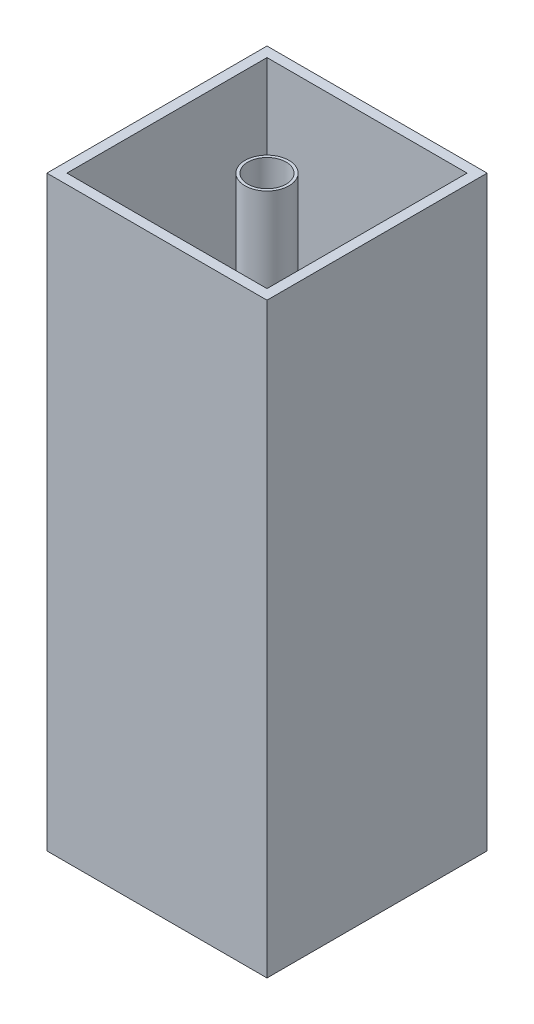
from build123d import *

# Parameters (mm, degrees)
SKETCH1_R           = 15
BOSS_EXTRUDE1_DEPTH = 400
SKETCH2_R           = 13.054210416
CUT_EXTRUDE1_DEPTH  = 400
SKETCH3_W           = 150
SKETCH3_H           = 150
SKETCH3_W_2         = 136.341784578
SKETCH3_H_2         = 136.341784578
BOSS_EXTRUDE2_DEPTH = 400
SKETCH4_W           = 150
SKETCH4_H           = 150
BOSS_EXTRUDE3_DEPTH = 10


with BuildPart() as part:
    # Sketch1 → Boss-Extrude1 (new body)
    with BuildSketch(Plane(origin=(0, 0, 0), x_dir=(1, 0, 0), z_dir=(0, 1, 0))):
        with Locations(Location((0, 0, 0), (0, 0, 270))):
            Circle(SKETCH1_R)
    extrude(amount=BOSS_EXTRUDE1_DEPTH)

    # Sketch2 → Cut-Extrude1 (cut)
    with BuildSketch(Plane(origin=(0, 400, 0), x_dir=(1, 0, 0), z_dir=(0, 1, 0))):
        with Locations(Location((0, 0, 0), (0, 0, 270))):
            Circle(SKETCH2_R)
    extrude(amount=-CUT_EXTRUDE1_DEPTH, mode=Mode.SUBTRACT)



with BuildPart() as body_2:
    # Sketch3 → Boss-Extrude2 (new body)
    with BuildSketch(Plane(origin=(0, 400, 0), x_dir=(1, 0, 0), z_dir=(0, 1, 0))):
        Rectangle(SKETCH3_W, SKETCH3_H)
        Rectangle(SKETCH3_W_2, SKETCH3_H_2, mode=Mode.SUBTRACT)
    extrude(amount=-BOSS_EXTRUDE2_DEPTH)


with BuildPart() as part_1:
    add(part.part)

    add(body_2.part)  # Boss-Extrude3 merges body 2
    # Sketch4 → Boss-Extrude3 (add)
    with BuildSketch(Plane.XZ):
        Rectangle(SKETCH4_W, SKETCH4_H)
    extrude(amount=-BOSS_EXTRUDE3_DEPTH)


solid = part_1.part
